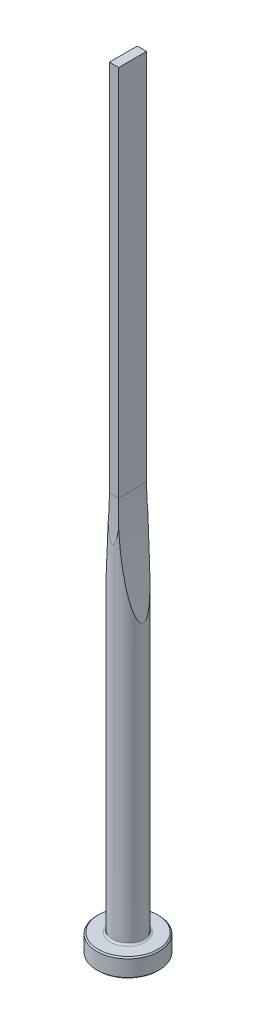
from build123d import *

# Parameters (mm, degrees)
CUT_EXTRUDE1_DEPTH = 5
CUT_EXTRUDE2_DEPTH = 5


with BuildPart() as part:
    # Sketch1 → Revolve1 (revolve)
    with BuildSketch(Plane.XY, mode=Mode.PRIVATE) as revolve1_sk:
        with BuildLine():
            Line((0, 0), (4.8, 0))
            Line((4.8, 0), (5, 0.2))
            Line((5, 0.2), (5, 2.8))
            Line((5, 2.8), (4.8, 3))
            Line((4.8, 3), (2.8, 3))
            ThreePointArc((2.8, 3), (2.587867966, 3.087867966), (2.5, 3.3))
            Line((2.5, 3.3), (2.5, 125))
            Line((2.5, 125), (0, 125))
            Line((0, 125), (0, 0))
        make_face()
    revolve(revolve1_sk.sketch.rotate(Axis((0, 125, 0), (0, -1, 0)), 180), axis=Axis((0, 125, 0), (0, -1, 0)))

    # Sketch2 → Cut-Extrude1 (cut, symmetric)
    with BuildSketch(Plane.XY):
        with BuildLine():
            Line((0.75, 125), (0.75, 65))
            ThreePointArc((0.75, 65), (1.188568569, 56.125880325), (2.5, 47.338247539))
            Line((2.5, 47.338247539), (2.5, 125))
            Line((2.5, 125), (0.75, 125))
        make_face()
        with BuildLine():
            Line((-0.75, 125), (-0.75, 65))
            ThreePointArc((-0.75, 65), (-1.188568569, 56.125880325), (-2.5, 47.338247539))
            Line((-2.5, 47.338247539), (-2.5, 125))
            Line((-2.5, 125), (-0.75, 125))
        make_face()
    extrude(amount=CUT_EXTRUDE1_DEPTH, both=True, mode=Mode.SUBTRACT)

    # Sketch3 → Cut-Extrude2 (cut, symmetric)
    with BuildSketch(Plane(origin=(0, 0, 0), x_dir=(0, 0, -1), z_dir=(1, 0, 0))):
        with BuildLine():
            Line((2.25, 125), (2.25, 65))
            ThreePointArc((2.25, 65), (2.312521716, 61.645898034), (2.5, 58.296456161))
            Line((2.5, 58.296456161), (2.5, 125))
            Line((2.5, 125), (2.25, 125))
        make_face()
        with BuildLine():
            Line((-2.25, 125), (-2.25, 65))
            ThreePointArc((-2.25, 65), (-2.312521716, 61.645898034), (-2.5, 58.296456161))
            Line((-2.5, 58.296456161), (-2.5, 125))
            Line((-2.5, 125), (-2.25, 125))
        make_face()
    extrude(amount=CUT_EXTRUDE2_DEPTH, both=True, mode=Mode.SUBTRACT)


solid = part.part
